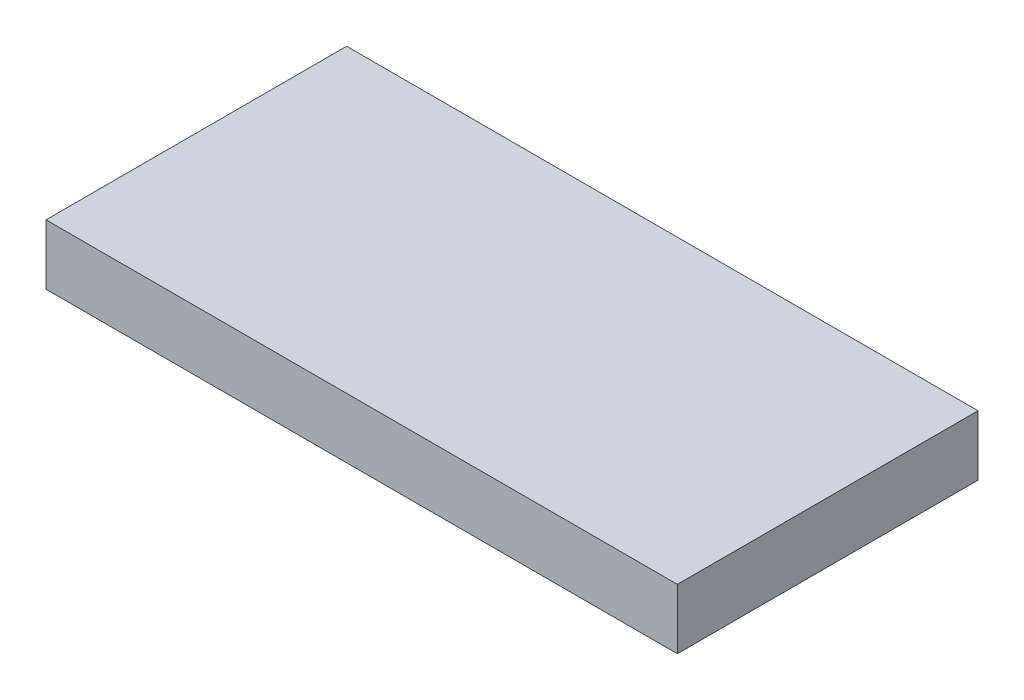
ISO-10303-21;
HEADER;
FILE_DESCRIPTION(('STEP AP214'),'2;1');
FILE_NAME('part.step','',(''),(''),'','','');
FILE_SCHEMA(('AUTOMOTIVE_DESIGN { 1 0 10303 214 1 1 1 1 }'));
ENDSEC;
DATA;
#1=APPLICATION_CONTEXT('core data for automotive mechanical design processes');
#2=APPLICATION_PROTOCOL_DEFINITION('international standard','automotive_design',2000,#1);
#3=PRODUCT_CONTEXT('',#1,'mechanical');
#4=PRODUCT('Part','Part','',(#3));
#5=PRODUCT_RELATED_PRODUCT_CATEGORY('part','',(#4));
#6=PRODUCT_DEFINITION_FORMATION('','',#4);
#7=PRODUCT_DEFINITION_CONTEXT('part definition',#1,'design');
#8=PRODUCT_DEFINITION('design','',#6,#7);
#9=PRODUCT_DEFINITION_SHAPE('','',#8);
#10=(LENGTH_UNIT() NAMED_UNIT(*) SI_UNIT(.MILLI.,.METRE.));
#11=(NAMED_UNIT(*) PLANE_ANGLE_UNIT() SI_UNIT($,.RADIAN.));
#12=(NAMED_UNIT(*) SI_UNIT($,.STERADIAN.) SOLID_ANGLE_UNIT());
#13=UNCERTAINTY_MEASURE_WITH_UNIT(LENGTH_MEASURE(1.E-05),#10,'distance_accuracy_value','');
#14=(GEOMETRIC_REPRESENTATION_CONTEXT(3) GLOBAL_UNCERTAINTY_ASSIGNED_CONTEXT((#13)) GLOBAL_UNIT_ASSIGNED_CONTEXT((#10,
#11,#12)) REPRESENTATION_CONTEXT('',''));
#15=CARTESIAN_POINT('',(0.,0.,0.));
#16=DIRECTION('',(0.,0.,1.));
#17=DIRECTION('',(1.,0.,0.));
#18=AXIS2_PLACEMENT_3D('',#15,#16,#17);
#19=CARTESIAN_POINT('',(-34.29,5.08,10.16));
#20=DIRECTION('',(1.,0.,0.));
#21=DIRECTION('',(0.,0.,-1.));
#22=AXIS2_PLACEMENT_3D('',#19,#20,#21);
#23=PLANE('',#22);
#24=DIRECTION('',(0.,0.,1.));
#25=VECTOR('',#24,1.);
#26=CARTESIAN_POINT('',(-34.29,0.,10.16));
#27=LINE('',#26,#25);
#28=CARTESIAN_POINT('',(-34.29,0.,-15.24));
#29=VERTEX_POINT('',#28);
#30=CARTESIAN_POINT('',(-34.29,0.,10.16));
#31=VERTEX_POINT('',#30);
#32=EDGE_CURVE('E96',#29,#31,#27,.T.);
#33=ORIENTED_EDGE('',*,*,#32,.T.);
#34=DIRECTION('',(0.,-1.,0.));
#35=VECTOR('',#34,1.);
#36=CARTESIAN_POINT('',(-34.29,5.08,10.16));
#37=LINE('',#36,#35);
#38=CARTESIAN_POINT('',(-34.29,5.08,10.16));
#39=VERTEX_POINT('',#38);
#40=EDGE_CURVE('E11',#39,#31,#37,.T.);
#41=ORIENTED_EDGE('',*,*,#40,.F.);
#42=DIRECTION('',(0.,0.,1.));
#43=VECTOR('',#42,1.);
#44=CARTESIAN_POINT('',(-34.29,5.08,10.16));
#45=LINE('',#44,#43);
#46=CARTESIAN_POINT('',(-34.29,5.08,-15.24));
#47=VERTEX_POINT('',#46);
#48=EDGE_CURVE('E84',#47,#39,#45,.T.);
#49=ORIENTED_EDGE('',*,*,#48,.F.);
#50=DIRECTION('',(0.,-1.,0.));
#51=VECTOR('',#50,1.);
#52=CARTESIAN_POINT('',(-34.29,5.08,-15.24));
#53=LINE('',#52,#51);
#54=EDGE_CURVE('E92',#47,#29,#53,.T.);
#55=ORIENTED_EDGE('',*,*,#54,.T.);
#56=EDGE_LOOP('',(#33,#41,#49,#55));
#57=FACE_BOUND('',#56,.T.);
#58=ADVANCED_FACE('F33',(#57),#23,.F.);
#59=CARTESIAN_POINT('',(-34.29,5.08,10.16));
#60=DIRECTION('',(0.,0.,-1.));
#61=DIRECTION('',(-1.,0.,0.));
#62=AXIS2_PLACEMENT_3D('',#59,#60,#61);
#63=PLANE('',#62);
#64=DIRECTION('',(1.,0.,0.));
#65=VECTOR('',#64,1.);
#66=CARTESIAN_POINT('',(-34.29,0.,10.16));
#67=LINE('',#66,#65);
#68=CARTESIAN_POINT('',(19.05,0.,10.16));
#69=VERTEX_POINT('',#68);
#70=EDGE_CURVE('E88',#31,#69,#67,.T.);
#71=ORIENTED_EDGE('',*,*,#70,.T.);
#72=DIRECTION('',(0.,-1.,0.));
#73=VECTOR('',#72,1.);
#74=CARTESIAN_POINT('',(19.05,5.08,10.16));
#75=LINE('',#74,#73);
#76=CARTESIAN_POINT('',(19.05,5.08,10.16));
#77=VERTEX_POINT('',#76);
#78=EDGE_CURVE('E41',#77,#69,#75,.T.);
#79=ORIENTED_EDGE('',*,*,#78,.F.);
#80=DIRECTION('',(1.,0.,0.));
#81=VECTOR('',#80,1.);
#82=CARTESIAN_POINT('',(-34.29,5.08,10.16));
#83=LINE('',#82,#81);
#84=EDGE_CURVE('E79',#39,#77,#83,.T.);
#85=ORIENTED_EDGE('',*,*,#84,.F.);
#86=ORIENTED_EDGE('',*,*,#40,.T.);
#87=EDGE_LOOP('',(#71,#79,#85,#86));
#88=FACE_BOUND('',#87,.T.);
#89=ADVANCED_FACE('F87',(#88),#63,.F.);
#90=CARTESIAN_POINT('',(19.05,5.08,10.16));
#91=DIRECTION('',(-1.,0.,0.));
#92=DIRECTION('',(0.,0.,1.));
#93=AXIS2_PLACEMENT_3D('',#90,#91,#92);
#94=PLANE('',#93);
#95=DIRECTION('',(0.,0.,-1.));
#96=VECTOR('',#95,1.);
#97=CARTESIAN_POINT('',(19.05,0.,10.16));
#98=LINE('',#97,#96);
#99=CARTESIAN_POINT('',(19.05,0.,-15.24));
#100=VERTEX_POINT('',#99);
#101=EDGE_CURVE('E66',#69,#100,#98,.T.);
#102=ORIENTED_EDGE('',*,*,#101,.T.);
#103=DIRECTION('',(0.,-1.,0.));
#104=VECTOR('',#103,1.);
#105=CARTESIAN_POINT('',(19.05,5.08,-15.24));
#106=LINE('',#105,#104);
#107=CARTESIAN_POINT('',(19.05,5.08,-15.24));
#108=VERTEX_POINT('',#107);
#109=EDGE_CURVE('E89',#108,#100,#106,.T.);
#110=ORIENTED_EDGE('',*,*,#109,.F.);
#111=DIRECTION('',(0.,0.,-1.));
#112=VECTOR('',#111,1.);
#113=CARTESIAN_POINT('',(19.05,5.08,10.16));
#114=LINE('',#113,#112);
#115=EDGE_CURVE('E82',#77,#108,#114,.T.);
#116=ORIENTED_EDGE('',*,*,#115,.F.);
#117=ORIENTED_EDGE('',*,*,#78,.T.);
#118=EDGE_LOOP('',(#102,#110,#116,#117));
#119=FACE_BOUND('',#118,.T.);
#120=ADVANCED_FACE('F90',(#119),#94,.F.);
#121=CARTESIAN_POINT('',(-34.29,5.08,-15.24));
#122=DIRECTION('',(0.,0.,1.));
#123=DIRECTION('',(1.,0.,0.));
#124=AXIS2_PLACEMENT_3D('',#121,#122,#123);
#125=PLANE('',#124);
#126=DIRECTION('',(-1.,0.,0.));
#127=VECTOR('',#126,1.);
#128=CARTESIAN_POINT('',(-34.29,0.,-15.24));
#129=LINE('',#128,#127);
#130=EDGE_CURVE('E72',#100,#29,#129,.T.);
#131=ORIENTED_EDGE('',*,*,#130,.T.);
#132=ORIENTED_EDGE('',*,*,#54,.F.);
#133=DIRECTION('',(-1.,0.,0.));
#134=VECTOR('',#133,1.);
#135=CARTESIAN_POINT('',(-34.29,5.08,-15.24));
#136=LINE('',#135,#134);
#137=EDGE_CURVE('E49',#108,#47,#136,.T.);
#138=ORIENTED_EDGE('',*,*,#137,.F.);
#139=ORIENTED_EDGE('',*,*,#109,.T.);
#140=EDGE_LOOP('',(#131,#132,#138,#139));
#141=FACE_BOUND('',#140,.T.);
#142=ADVANCED_FACE('F103',(#141),#125,.F.);
#143=CARTESIAN_POINT('',(0.,5.08,0.));
#144=DIRECTION('',(0.,-1.,0.));
#145=DIRECTION('',(0.,0.,-1.));
#146=AXIS2_PLACEMENT_3D('',#143,#144,#145);
#147=PLANE('',#146);
#148=ORIENTED_EDGE('',*,*,#48,.T.);
#149=ORIENTED_EDGE('',*,*,#84,.T.);
#150=ORIENTED_EDGE('',*,*,#115,.T.);
#151=ORIENTED_EDGE('',*,*,#137,.T.);
#152=EDGE_LOOP('',(#148,#149,#150,#151));
#153=FACE_BOUND('',#152,.T.);
#154=ADVANCED_FACE('F80',(#153),#147,.F.);
#155=CARTESIAN_POINT('',(0.,0.,0.));
#156=DIRECTION('',(0.,-1.,0.));
#157=DIRECTION('',(0.,0.,-1.));
#158=AXIS2_PLACEMENT_3D('',#155,#156,#157);
#159=PLANE('',#158);
#160=ORIENTED_EDGE('',*,*,#32,.F.);
#161=ORIENTED_EDGE('',*,*,#130,.F.);
#162=ORIENTED_EDGE('',*,*,#101,.F.);
#163=ORIENTED_EDGE('',*,*,#70,.F.);
#164=EDGE_LOOP('',(#160,#161,#162,#163));
#165=FACE_BOUND('',#164,.T.);
#166=ADVANCED_FACE('F106',(#165),#159,.T.);
#167=CLOSED_SHELL('',(#58,#89,#120,#142,#154,#166));
#168=MANIFOLD_SOLID_BREP('B2',#167);
#169=ADVANCED_BREP_SHAPE_REPRESENTATION('',(#18,#168),#14);
#170=SHAPE_DEFINITION_REPRESENTATION(#9,#169);
ENDSEC;
END-ISO-10303-21;
